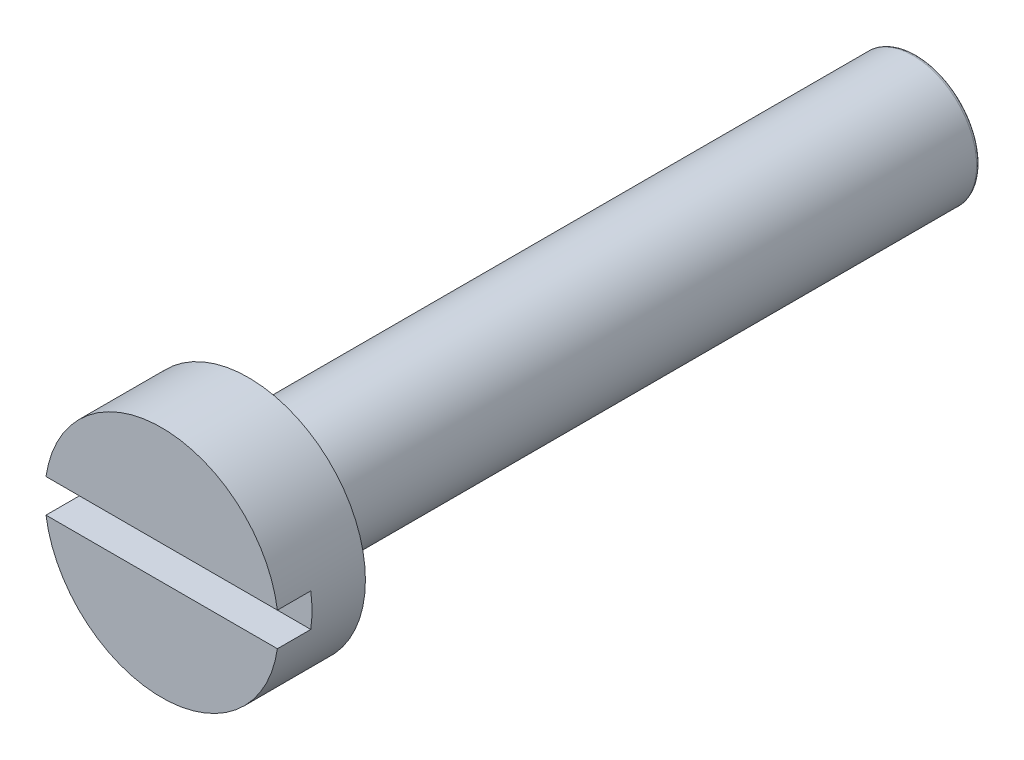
ISO-10303-21;
HEADER;
FILE_DESCRIPTION(('STEP AP214'),'2;1');
FILE_NAME('part.step','',(''),(''),'','','');
FILE_SCHEMA(('AUTOMOTIVE_DESIGN { 1 0 10303 214 1 1 1 1 }'));
ENDSEC;
DATA;
#1=APPLICATION_CONTEXT('core data for automotive mechanical design processes');
#2=APPLICATION_PROTOCOL_DEFINITION('international standard','automotive_design',2000,#1);
#3=PRODUCT_CONTEXT('',#1,'mechanical');
#4=PRODUCT('Part','Part','',(#3));
#5=PRODUCT_RELATED_PRODUCT_CATEGORY('part','',(#4));
#6=PRODUCT_DEFINITION_FORMATION('','',#4);
#7=PRODUCT_DEFINITION_CONTEXT('part definition',#1,'design');
#8=PRODUCT_DEFINITION('design','',#6,#7);
#9=PRODUCT_DEFINITION_SHAPE('','',#8);
#10=(LENGTH_UNIT() NAMED_UNIT(*) SI_UNIT(.MILLI.,.METRE.));
#11=(NAMED_UNIT(*) PLANE_ANGLE_UNIT() SI_UNIT($,.RADIAN.));
#12=(NAMED_UNIT(*) SI_UNIT($,.STERADIAN.) SOLID_ANGLE_UNIT());
#13=UNCERTAINTY_MEASURE_WITH_UNIT(LENGTH_MEASURE(1.E-05),#10,'distance_accuracy_value','');
#14=(GEOMETRIC_REPRESENTATION_CONTEXT(3) GLOBAL_UNCERTAINTY_ASSIGNED_CONTEXT((#13)) GLOBAL_UNIT_ASSIGNED_CONTEXT((#10,
#11,#12)) REPRESENTATION_CONTEXT('',''));
#15=CARTESIAN_POINT('',(0.,0.,0.));
#16=DIRECTION('',(0.,0.,1.));
#17=DIRECTION('',(1.,0.,0.));
#18=AXIS2_PLACEMENT_3D('',#15,#16,#17);
#19=CARTESIAN_POINT('',(0.,0.,0.));
#20=DIRECTION('',(0.,0.,1.));
#21=DIRECTION('',(1.,0.,0.));
#22=AXIS2_PLACEMENT_3D('',#19,#20,#21);
#23=PLANE('',#22);
#24=CARTESIAN_POINT('',(0.,0.,0.));
#25=DIRECTION('',(0.,0.,1.));
#26=DIRECTION('',(1.,0.,0.));
#27=AXIS2_PLACEMENT_3D('',#24,#25,#26);
#28=CIRCLE('',#27,3.5);
#29=CARTESIAN_POINT('',(3.5,0.,0.));
#30=VERTEX_POINT('',#29);
#31=EDGE_CURVE('E88',#30,#30,#28,.T.);
#32=ORIENTED_EDGE('',*,*,#31,.F.);
#33=EDGE_LOOP('',(#32));
#34=FACE_BOUND('',#33,.T.);
#35=CARTESIAN_POINT('',(0.,0.,0.));
#36=DIRECTION('',(0.,0.,1.));
#37=DIRECTION('',(1.,0.,0.));
#38=AXIS2_PLACEMENT_3D('',#35,#36,#37);
#39=CIRCLE('',#38,1.9);
#40=CARTESIAN_POINT('',(1.9,0.,0.));
#41=VERTEX_POINT('',#40);
#42=EDGE_CURVE('E99',#41,#41,#39,.F.);
#43=ORIENTED_EDGE('',*,*,#42,.F.);
#44=EDGE_LOOP('',(#43));
#45=FACE_BOUND('',#44,.T.);
#46=ADVANCED_FACE('F27',(#34,#45),#23,.F.);
#47=CARTESIAN_POINT('',(0.,0.,2.6));
#48=DIRECTION('',(0.,0.,1.));
#49=DIRECTION('',(1.,0.,0.));
#50=AXIS2_PLACEMENT_3D('',#47,#48,#49);
#51=PLANE('',#50);
#52=DIRECTION('',(-1.,0.,0.));
#53=VECTOR('',#52,1.);
#54=CARTESIAN_POINT('',(0.,0.5,2.6));
#55=LINE('',#54,#53);
#56=CARTESIAN_POINT('',(3.46410161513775,0.5,2.6));
#57=VERTEX_POINT('',#56);
#58=CARTESIAN_POINT('',(-3.46410161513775,0.5,2.6));
#59=VERTEX_POINT('',#58);
#60=EDGE_CURVE('E75',#57,#59,#55,.T.);
#61=ORIENTED_EDGE('',*,*,#60,.F.);
#62=CARTESIAN_POINT('',(0.,0.,2.6));
#63=DIRECTION('',(0.,0.,1.));
#64=DIRECTION('',(1.,0.,0.));
#65=AXIS2_PLACEMENT_3D('',#62,#63,#64);
#66=CIRCLE('',#65,3.5);
#67=EDGE_CURVE('E76',#57,#59,#66,.T.);
#68=ORIENTED_EDGE('',*,*,#67,.T.);
#69=EDGE_LOOP('',(#61,#68));
#70=FACE_BOUND('',#69,.T.);
#71=ADVANCED_FACE('F117',(#70),#51,.T.);
#72=CARTESIAN_POINT('',(0.,0.,2.6));
#73=DIRECTION('',(0.,0.,-1.));
#74=DIRECTION('',(-1.,0.,0.));
#75=AXIS2_PLACEMENT_3D('',#72,#73,#74);
#76=CYLINDRICAL_SURFACE('',#75,3.5);
#77=CARTESIAN_POINT('',(0.,0.,1.6));
#78=DIRECTION('',(0.,0.,1.));
#79=DIRECTION('',(1.,0.,0.));
#80=AXIS2_PLACEMENT_3D('',#77,#78,#79);
#81=CIRCLE('',#80,3.5);
#82=CARTESIAN_POINT('',(-3.46410161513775,0.5,1.6));
#83=VERTEX_POINT('',#82);
#84=CARTESIAN_POINT('',(-3.46410161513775,-0.5,1.6));
#85=VERTEX_POINT('',#84);
#86=EDGE_CURVE('E98',#83,#85,#81,.T.);
#87=ORIENTED_EDGE('',*,*,#86,.F.);
#88=DIRECTION('',(0.,0.,-1.));
#89=VECTOR('',#88,1.);
#90=CARTESIAN_POINT('',(-3.46410161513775,0.5,2.6));
#91=LINE('',#90,#89);
#92=EDGE_CURVE('E50',#83,#59,#91,.F.);
#93=ORIENTED_EDGE('',*,*,#92,.T.);
#94=ORIENTED_EDGE('',*,*,#67,.F.);
#95=DIRECTION('',(0.,0.,-1.));
#96=VECTOR('',#95,1.);
#97=CARTESIAN_POINT('',(3.46410161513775,0.5,2.6));
#98=LINE('',#97,#96);
#99=CARTESIAN_POINT('',(3.46410161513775,0.5,1.6));
#100=VERTEX_POINT('',#99);
#101=EDGE_CURVE('E92',#57,#100,#98,.T.);
#102=ORIENTED_EDGE('',*,*,#101,.T.);
#103=CARTESIAN_POINT('',(3.46410161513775,-0.5,1.6));
#104=VERTEX_POINT('',#103);
#105=EDGE_CURVE('E84',#104,#100,#81,.T.);
#106=ORIENTED_EDGE('',*,*,#105,.F.);
#107=DIRECTION('',(0.,0.,-1.));
#108=VECTOR('',#107,1.);
#109=CARTESIAN_POINT('',(3.46410161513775,-0.5,2.6));
#110=LINE('',#109,#108);
#111=CARTESIAN_POINT('',(3.46410161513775,-0.5,2.6));
#112=VERTEX_POINT('',#111);
#113=EDGE_CURVE('E70',#104,#112,#110,.F.);
#114=ORIENTED_EDGE('',*,*,#113,.T.);
#115=CARTESIAN_POINT('',(-3.46410161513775,-0.5,2.6));
#116=VERTEX_POINT('',#115);
#117=EDGE_CURVE('E82',#116,#112,#66,.T.);
#118=ORIENTED_EDGE('',*,*,#117,.F.);
#119=DIRECTION('',(0.,0.,-1.));
#120=VECTOR('',#119,1.);
#121=CARTESIAN_POINT('',(-3.46410161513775,-0.5,2.6));
#122=LINE('',#121,#120);
#123=EDGE_CURVE('E42',#116,#85,#122,.T.);
#124=ORIENTED_EDGE('',*,*,#123,.T.);
#125=EDGE_LOOP('',(#87,#93,#94,#102,#106,#114,#118,#124));
#126=FACE_BOUND('',#125,.T.);
#127=ORIENTED_EDGE('',*,*,#31,.T.);
#128=EDGE_LOOP('',(#127));
#129=FACE_BOUND('',#128,.T.);
#130=ADVANCED_FACE('F29',(#126,#129),#76,.T.);
#131=DIRECTION('',(1.,0.,0.));
#132=VECTOR('',#131,1.);
#133=CARTESIAN_POINT('',(0.,-0.5,2.6));
#134=LINE('',#133,#132);
#135=EDGE_CURVE('E67',#116,#112,#134,.T.);
#136=ORIENTED_EDGE('',*,*,#135,.F.);
#137=ORIENTED_EDGE('',*,*,#117,.T.);
#138=EDGE_LOOP('',(#136,#137));
#139=FACE_BOUND('',#138,.T.);
#140=ADVANCED_FACE('F87',(#139),#51,.T.);
#141=CARTESIAN_POINT('',(-10.,-0.5,1.6));
#142=DIRECTION('',(0.,0.,1.));
#143=DIRECTION('',(1.,0.,0.));
#144=AXIS2_PLACEMENT_3D('',#141,#142,#143);
#145=PLANE('',#144);
#146=ORIENTED_EDGE('',*,*,#86,.T.);
#147=DIRECTION('',(1.,0.,0.));
#148=VECTOR('',#147,1.);
#149=CARTESIAN_POINT('',(-10.,-0.5,1.6));
#150=LINE('',#149,#148);
#151=EDGE_CURVE('E184',#85,#104,#150,.T.);
#152=ORIENTED_EDGE('',*,*,#151,.T.);
#153=ORIENTED_EDGE('',*,*,#105,.T.);
#154=DIRECTION('',(-1.,0.,0.));
#155=VECTOR('',#154,1.);
#156=CARTESIAN_POINT('',(-10.,0.5,1.6));
#157=LINE('',#156,#155);
#158=EDGE_CURVE('E85',#100,#83,#157,.T.);
#159=ORIENTED_EDGE('',*,*,#158,.T.);
#160=EDGE_LOOP('',(#146,#152,#153,#159));
#161=FACE_BOUND('',#160,.T.);
#162=ADVANCED_FACE('F131',(#161),#145,.T.);
#163=CARTESIAN_POINT('',(-10.,0.5,1.6));
#164=DIRECTION('',(0.,1.,0.));
#165=DIRECTION('',(0.,0.,1.));
#166=AXIS2_PLACEMENT_3D('',#163,#164,#165);
#167=PLANE('',#166);
#168=ORIENTED_EDGE('',*,*,#60,.T.);
#169=ORIENTED_EDGE('',*,*,#92,.F.);
#170=ORIENTED_EDGE('',*,*,#158,.F.);
#171=ORIENTED_EDGE('',*,*,#101,.F.);
#172=EDGE_LOOP('',(#168,#169,#170,#171));
#173=FACE_BOUND('',#172,.T.);
#174=ADVANCED_FACE('F136',(#173),#167,.F.);
#175=CARTESIAN_POINT('',(-10.,-0.5,1.6));
#176=DIRECTION('',(0.,-1.,0.));
#177=DIRECTION('',(0.,0.,-1.));
#178=AXIS2_PLACEMENT_3D('',#175,#176,#177);
#179=PLANE('',#178);
#180=ORIENTED_EDGE('',*,*,#135,.T.);
#181=ORIENTED_EDGE('',*,*,#113,.F.);
#182=ORIENTED_EDGE('',*,*,#151,.F.);
#183=ORIENTED_EDGE('',*,*,#123,.F.);
#184=EDGE_LOOP('',(#180,#181,#182,#183));
#185=FACE_BOUND('',#184,.T.);
#186=ADVANCED_FACE('F69',(#185),#179,.F.);
#187=CARTESIAN_POINT('',(0.,0.,-20.));
#188=DIRECTION('',(0.,0.,1.));
#189=DIRECTION('',(1.,0.,0.));
#190=AXIS2_PLACEMENT_3D('',#187,#188,#189);
#191=CYLINDRICAL_SURFACE('',#190,1.9);
#192=CARTESIAN_POINT('',(0.,0.,-19.9));
#193=DIRECTION('',(0.,0.,-1.));
#194=DIRECTION('',(-1.,0.,0.));
#195=AXIS2_PLACEMENT_3D('',#192,#193,#194);
#196=CIRCLE('',#195,1.9);
#197=CARTESIAN_POINT('',(-1.9,0.,-19.9));
#198=VERTEX_POINT('',#197);
#199=EDGE_CURVE('E11',#198,#198,#196,.F.);
#200=ORIENTED_EDGE('',*,*,#199,.T.);
#201=EDGE_LOOP('',(#200));
#202=FACE_BOUND('',#201,.T.);
#203=ORIENTED_EDGE('',*,*,#42,.T.);
#204=EDGE_LOOP('',(#203));
#205=FACE_BOUND('',#204,.T.);
#206=ADVANCED_FACE('F113',(#202,#205),#191,.T.);
#207=CARTESIAN_POINT('',(0.,0.,-20.));
#208=DIRECTION('',(0.,0.,-1.));
#209=DIRECTION('',(-1.,0.,0.));
#210=AXIS2_PLACEMENT_3D('',#207,#208,#209);
#211=PLANE('',#210);
#212=CARTESIAN_POINT('',(0.,0.,-20.));
#213=DIRECTION('',(0.,0.,-1.));
#214=DIRECTION('',(-1.,0.,0.));
#215=AXIS2_PLACEMENT_3D('',#212,#213,#214);
#216=CIRCLE('',#215,1.8);
#217=CARTESIAN_POINT('',(-1.8,0.,-20.));
#218=VERTEX_POINT('',#217);
#219=EDGE_CURVE('E35',#218,#218,#216,.T.);
#220=ORIENTED_EDGE('',*,*,#219,.T.);
#221=EDGE_LOOP('',(#220));
#222=FACE_BOUND('',#221,.T.);
#223=ADVANCED_FACE('F104',(#222),#211,.T.);
#224=CARTESIAN_POINT('',(0.,0.,-19.9));
#225=DIRECTION('',(0.,0.,-1.));
#226=DIRECTION('',(-1.,0.,0.));
#227=AXIS2_PLACEMENT_3D('',#224,#225,#226);
#228=TOROIDAL_SURFACE('',#227,1.8,0.1);
#229=ORIENTED_EDGE('',*,*,#199,.F.);
#230=EDGE_LOOP('',(#229));
#231=FACE_BOUND('',#230,.T.);
#232=ORIENTED_EDGE('',*,*,#219,.F.);
#233=EDGE_LOOP('',(#232));
#234=FACE_BOUND('',#233,.T.);
#235=ADVANCED_FACE('F106',(#231,#234),#228,.T.);
#236=CLOSED_SHELL('',(#46,#71,#130,#140,#162,#174,#186,#206,#223,#235));
#237=MANIFOLD_SOLID_BREP('B2',#236);
#238=ADVANCED_BREP_SHAPE_REPRESENTATION('',(#18,#237),#14);
#239=SHAPE_DEFINITION_REPRESENTATION(#9,#238);
ENDSEC;
END-ISO-10303-21;
